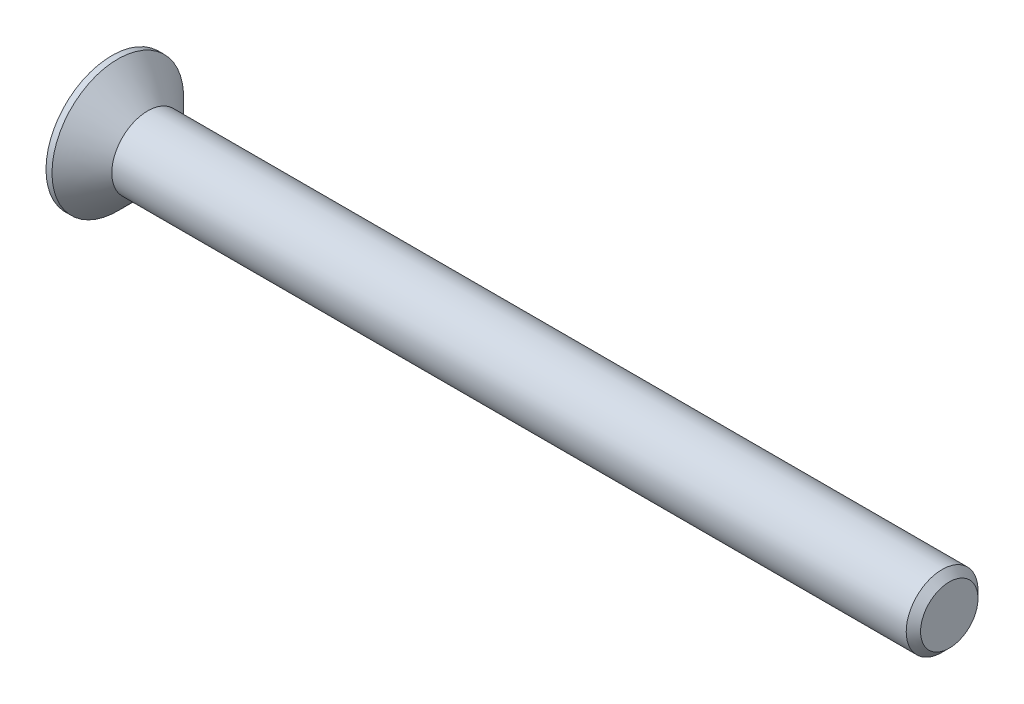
from build123d import *

# Parameters (mm, degrees)
CHAMFER1_SIZE      = 0.6
CUT_EXTRUDE1_DEPTH = 2.5


with BuildPart() as part:
    # Sketch1 → Revolve1 (revolve)
    with BuildSketch(Plane.XY, mode=Mode.PRIVATE) as revolve1_sk:
        Polygon((-3, 5.5), (-3, 0), (67, 0), (67, 3), (0, 3), (-2.5, 5.5), align=None)
    revolve(revolve1_sk.sketch.rotate(Axis((-3, 0, 0), (1, 0, 0)), 90), axis=Axis((-3, 0, 0), (1, 0, 0)))

    # Chamfer1
    chamfer1_edges = [part.edges().sort_by_distance(p)[0] for p in [
        (67, 0, -3),
    ]]
    chamfer(chamfer1_edges, length=CHAMFER1_SIZE)

    # Sketch2 → Cut-Extrude1 (cut)
    with BuildSketch(Plane.ZY.offset(3)):
        Polygon((-0.825, 3.3), (0.825, 3.3), (0.825, 0.825), (3.3, 0.825), (3.3, -0.825), (0.825, -0.825), (0.825, -3.3), (-0.825, -3.3), (-0.825, -0.825), (-3.3, -0.825), (-3.3, 0.825), (-0.825, 0.825), align=None)
    extrude(amount=-CUT_EXTRUDE1_DEPTH, mode=Mode.SUBTRACT)


solid = part.part
